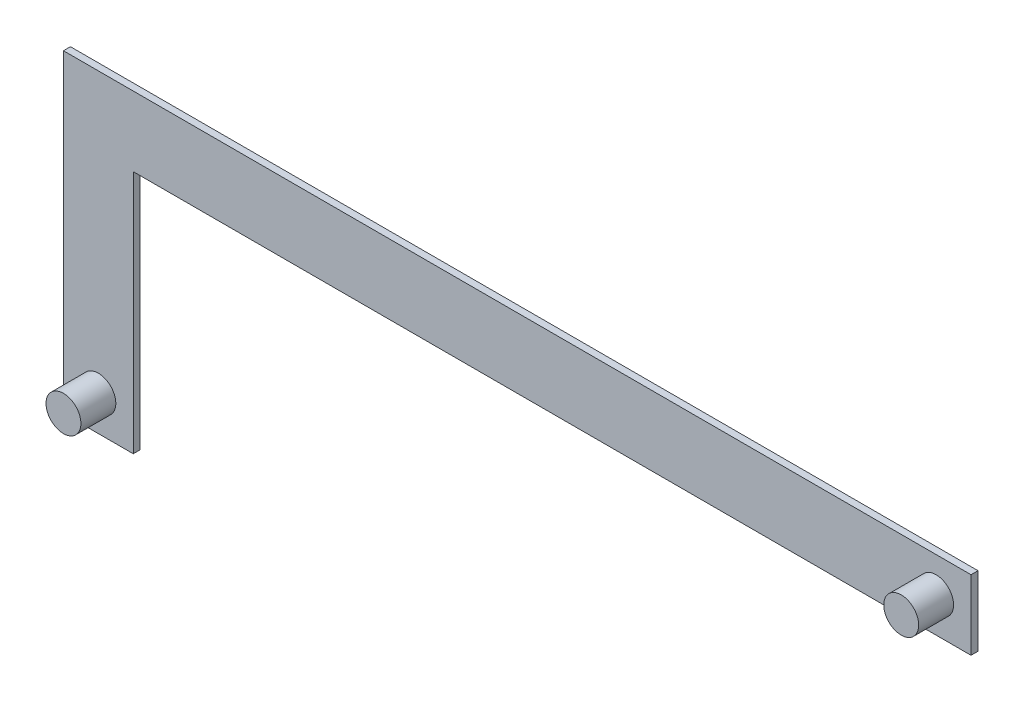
from build123d import *

# Parameters (mm, degrees)
SKETCH1_R        = 2.5
EXTRUDE1_DEPTH   = 5
EXTRUDE1_2_DEPTH = 5
EXTRUDE2_DEPTH   = 1


with BuildPart() as part:
    # Sketch1 → Extrude1 (new body)
    with BuildSketch(Plane.XY):
        Circle(SKETCH1_R)
    extrude(amount=EXTRUDE1_DEPTH)



with BuildPart() as body_2:
    # Sketch1 → Extrude1 2 (new body)
    with BuildSketch(Plane.XY):
        with Locations((120, 35)):
            Circle(SKETCH1_R)
    extrude(amount=EXTRUDE1_2_DEPTH)


with BuildPart() as part_1:
    add(part.part)

    add(body_2.part)  # Extrude2 merges body 2
    # Sketch2 → Extrude2 (add)
    with BuildSketch(Plane(origin=(0, 0, 0), x_dir=(-1, 0, 0), z_dir=(0, 0, -1))):
        Polygon((-125, 30), (-5, 30), (-5, -5), (5, -5), (5, 40), (-125, 40), align=None)
    extrude(amount=EXTRUDE2_DEPTH)


solid = part_1.part
